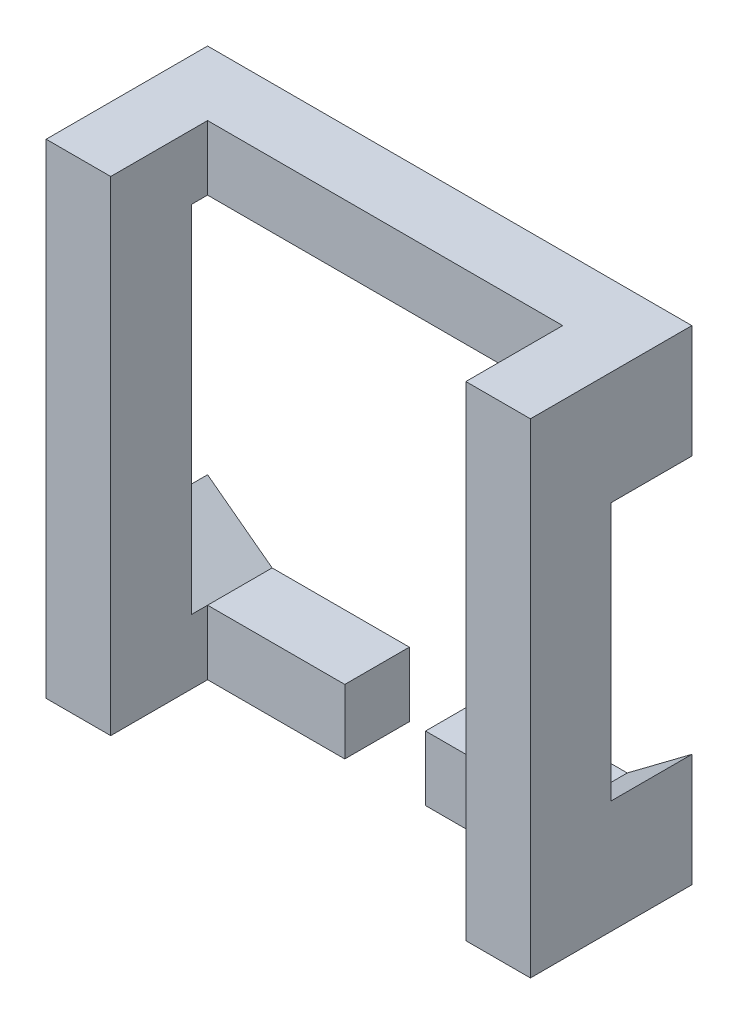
from build123d import *

# Parameters (mm, degrees)
SKETCH1_W           = 6
SKETCH1_H           = 6
BOSS_EXTRUDE1_DEPTH = 2
CUT_EXTRUDE1_DEPTH  = 1
SKETCH3_W           = 4.4
SKETCH3_H           = 4.4
CUT_EXTRUDE2_DEPTH  = 1
SKETCH4_W           = 4.4
SKETCH4_H           = 1.2
CUT_EXTRUDE3_DEPTH  = 9.717797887
CUT_EXTRUDE4_REACH  = 10.718
SKETCH5_W           = 1
SKETCH5_H           = 0.8


with BuildPart() as part:
    # Sketch1 → Boss-Extrude1 (new body)
    with BuildSketch(Plane.XY):
        with Locations((3, 3)):
            Rectangle(SKETCH1_W, SKETCH1_H)
    extrude(amount=BOSS_EXTRUDE1_DEPTH)

    # Sketch2 → Cut-Extrude1 (cut)
    with BuildSketch(Plane(origin=(0, 0, 0), x_dir=(-1, 0, 0), z_dir=(0, 0, -1))):
        Polygon((-5.2, 5.2), (-0.8, 5.2), (0, 4.6), (0, 1.4), (-0.8, 0.8), (-5.2, 0.8), (-6, 1.4), (-6, 4.6), align=None)
    extrude(amount=-CUT_EXTRUDE1_DEPTH, mode=Mode.SUBTRACT)

    # Sketch3 → Cut-Extrude2 (cut)
    with BuildSketch(Plane(origin=(0, 0, 1), x_dir=(-1, 0, 0), z_dir=(0, 0, -1))):
        with Locations((-3, 3)):
            Rectangle(SKETCH3_W, SKETCH3_H)
    extrude(amount=-CUT_EXTRUDE2_DEPTH, mode=Mode.SUBTRACT)

    # Sketch4 → Cut-Extrude3 (cut, through all)
    with BuildSketch(Plane.XZ):
        with Locations((3, 1.4)):
            Rectangle(SKETCH4_W, SKETCH4_H)
    extrude(amount=-CUT_EXTRUDE3_DEPTH, mode=Mode.SUBTRACT)

    # Sketch5 → Cut-Extrude4 (cut, up to next)
    with BuildSketch(Plane(origin=(0, 0, 0), x_dir=(-1, 0, 0), z_dir=(0, 0, -1)), mode=Mode.PRIVATE) as cut_extrude4_sk1:
        with Locations((-3, 0.4)):
            Rectangle(SKETCH5_W, SKETCH5_H)
    cut_extrude4_tool1 = extrude(cut_extrude4_sk1.sketch, amount=-CUT_EXTRUDE4_REACH, mode=Mode.PRIVATE) & part.part
    add(cut_extrude4_tool1.solids().sort_by_distance((3, 0.4, 0))[0], mode=Mode.SUBTRACT)


solid = part.part
